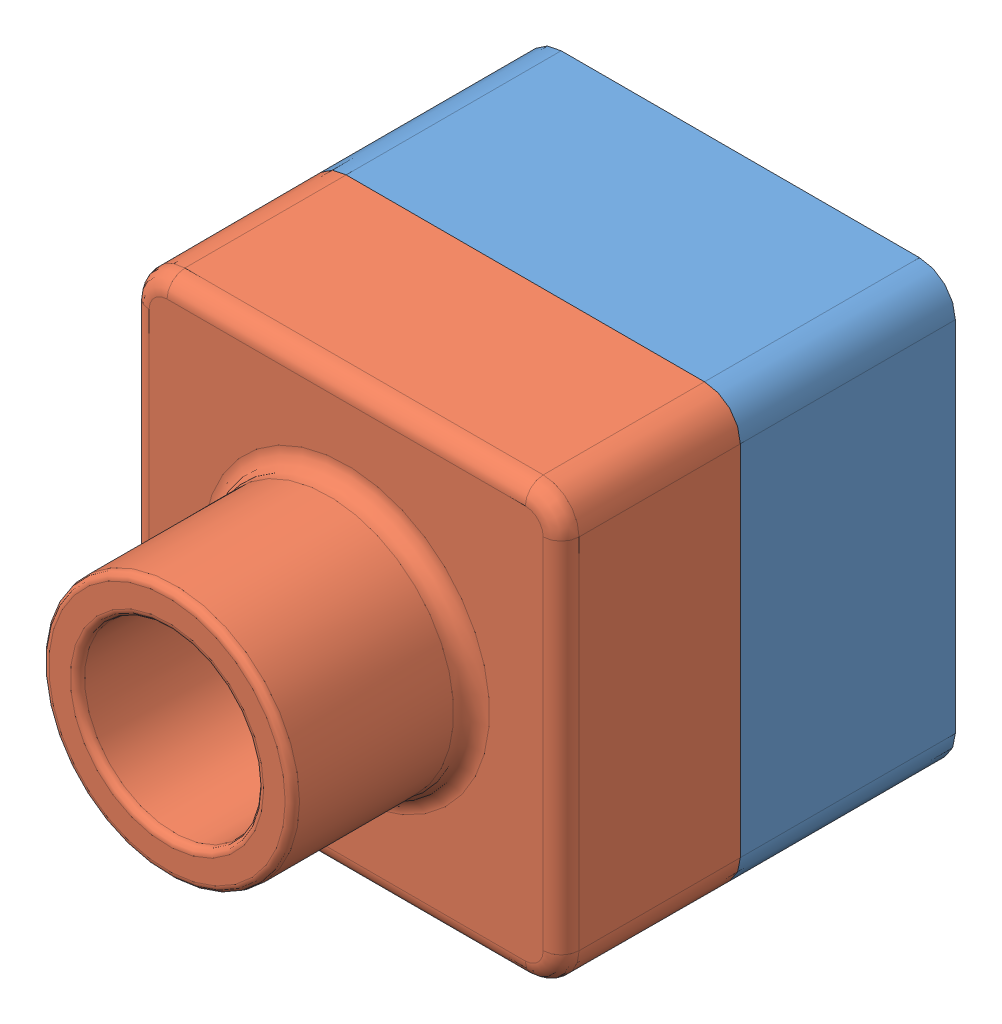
SolidWorks assembly Tutor Assembly.SLDASM, configuration Default (file format 4700). Lengths in mm.
Overall size (120 120 160).
2 component instances, 2 part files, 3 mates.
Components (placement in the parent):
- Tutor4-1: Tutor4.SLDPRT [Version 1] at origin size (120 120 90)
- Tutor3-1: Tutor3.SLDPRT [Default] at (0 0 110) size (120 120 100)
Mates (geometry in assembly coordinates):
- Coincident1: coincident aligned: plane of Tutor4-1 through (120 0 90) normal (1 0 0); plane of Tutor3-1 through (120 0 60) normal (1 0 0)
- Coincident2: coincident aligned: plane of Tutor4-1 through (0 120 90) normal (0 1 0); plane of Tutor3-1 through (0 120 60) normal (0 1 0)
- Coincident3: coincident aligned: line of Tutor4-1 through (110 120 60) axis (-1 0 0); line of Tutor3-1 through (110 120 60) axis (-1 0 0)
